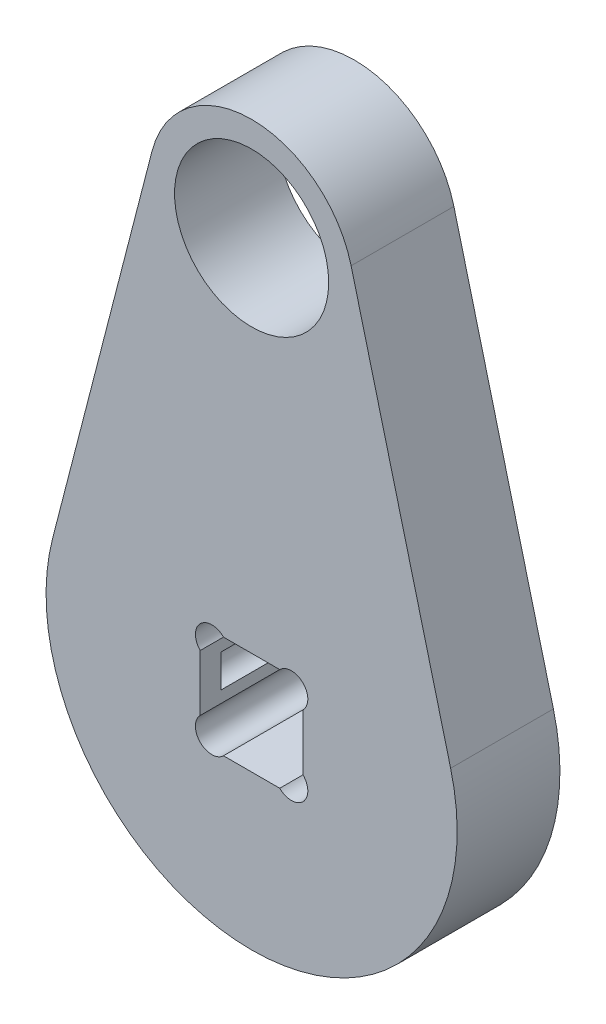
from build123d import *

# Parameters (mm, degrees)
ESQUISSE1_R             = 7.5
BOSS_EXTRU_1_DEPTH      = 10
ENL_V_MAT_EXTRU_1_DEPTH = 55.772255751
ESQUISSE3_R             = 1.6
ENL_V_MAT_EXTRU_2_DEPTH = 8


with BuildPart() as part:
    # Esquisse1 → Boss.-Extru.1 (new body)
    with BuildSketch(Plane.XY):
        with BuildLine():
            Line((9.682458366, 42.5), (19.364916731, 5))
            ThreePointArc((19.364916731, 5), (0, -20), (-19.364916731, 5))
            Line((-19.364916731, 5), (-9.682458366, 42.5))
            ThreePointArc((-9.682458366, 42.5), (0, 50), (9.682458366, 42.5))
        make_face()
        with Locations((0, 40)):
            Circle(ESQUISSE1_R, mode=Mode.SUBTRACT)
    extrude(amount=BOSS_EXTRU_1_DEPTH)

    # Esquisse2 → Enl_v. mat.-Extru.1 (cut, through all)
    with BuildSketch(Plane(origin=(0, 0, 0), x_dir=(-1, 0, 0), z_dir=(0, 0, -1))):
        with BuildLine():
            Line((-2.7372583, 5), (2.7372583, 5))
            ThreePointArc((2.7372583, 5), (5, 5), (5, 2.7372583))
            Line((5, 2.7372583), (5, -2.7372583))
            ThreePointArc((5, -2.7372583), (5, -5), (2.7372583, -5))
            Line((2.7372583, -5), (-2.7372583, -5))
            ThreePointArc((-2.7372583, -5), (-5, -5), (-5, -2.7372583))
            Line((-5, -2.7372583), (-5, 2.7372583))
            ThreePointArc((-5, 2.7372583), (-5, 5), (-2.7372583, 5))
        make_face()
    extrude(amount=-ENL_V_MAT_EXTRU_1_DEPTH, mode=Mode.SUBTRACT)

    # Esquisse3 → Enl_v. mat.-Extru.2 (cut)
    with BuildSketch(Plane(origin=(0, 0, 0), x_dir=(-1, 0, 0), z_dir=(0, 0, -1))):
        with Locations((-5, 0)):
            Circle(ESQUISSE3_R)
        with Locations((5, 0)):
            Circle(ESQUISSE3_R)
    extrude(amount=-ENL_V_MAT_EXTRU_2_DEPTH, mode=Mode.SUBTRACT)


solid = part.part
